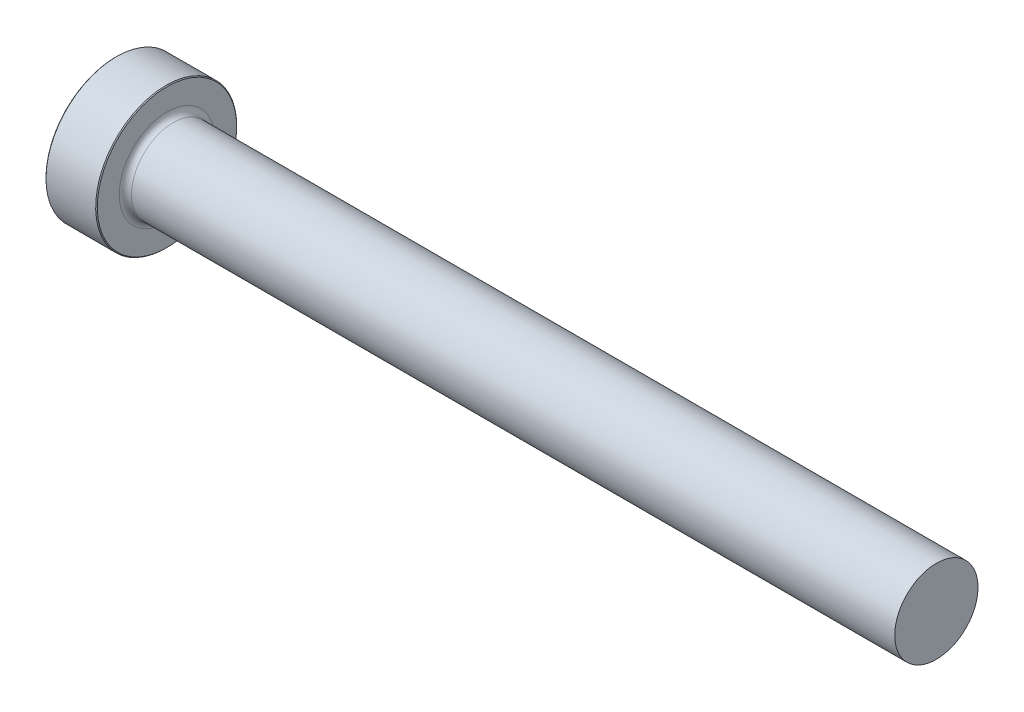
ISO-10303-21;
HEADER;
FILE_DESCRIPTION(('STEP AP214'),'2;1');
FILE_NAME('part.step','',(''),(''),'','','');
FILE_SCHEMA(('AUTOMOTIVE_DESIGN { 1 0 10303 214 1 1 1 1 }'));
ENDSEC;
DATA;
#1=APPLICATION_CONTEXT('core data for automotive mechanical design processes');
#2=APPLICATION_PROTOCOL_DEFINITION('international standard','automotive_design',2000,#1);
#3=PRODUCT_CONTEXT('',#1,'mechanical');
#4=PRODUCT('Part','Part','',(#3));
#5=PRODUCT_RELATED_PRODUCT_CATEGORY('part','',(#4));
#6=PRODUCT_DEFINITION_FORMATION('','',#4);
#7=PRODUCT_DEFINITION_CONTEXT('part definition',#1,'design');
#8=PRODUCT_DEFINITION('design','',#6,#7);
#9=PRODUCT_DEFINITION_SHAPE('','',#8);
#10=(LENGTH_UNIT() NAMED_UNIT(*) SI_UNIT(.MILLI.,.METRE.));
#11=(NAMED_UNIT(*) PLANE_ANGLE_UNIT() SI_UNIT($,.RADIAN.));
#12=(NAMED_UNIT(*) SI_UNIT($,.STERADIAN.) SOLID_ANGLE_UNIT());
#13=UNCERTAINTY_MEASURE_WITH_UNIT(LENGTH_MEASURE(1.E-05),#10,'distance_accuracy_value','');
#14=(GEOMETRIC_REPRESENTATION_CONTEXT(3) GLOBAL_UNCERTAINTY_ASSIGNED_CONTEXT((#13)) GLOBAL_UNIT_ASSIGNED_CONTEXT((#10,
#11,#12)) REPRESENTATION_CONTEXT('',''));
#15=CARTESIAN_POINT('',(0.,0.,0.));
#16=DIRECTION('',(0.,0.,1.));
#17=DIRECTION('',(1.,0.,0.));
#18=AXIS2_PLACEMENT_3D('',#15,#16,#17);
#19=CARTESIAN_POINT('',(101.6,5.15556499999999,0.));
#20=DIRECTION('',(1.,0.,0.));
#21=DIRECTION('',(0.,1.,0.));
#22=AXIS2_PLACEMENT_3D('',#19,#20,#21);
#23=PLANE('',#22);
#24=CARTESIAN_POINT('',(101.6,0.,0.));
#25=DIRECTION('',(1.,0.,0.));
#26=DIRECTION('',(0.,1.,0.));
#27=AXIS2_PLACEMENT_3D('',#24,#25,#26);
#28=CIRCLE('',#27,5.155565);
#29=CARTESIAN_POINT('',(101.6,5.15556499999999,0.));
#30=VERTEX_POINT('',#29);
#31=EDGE_CURVE('E50',#30,#30,#28,.T.);
#32=ORIENTED_EDGE('',*,*,#31,.T.);
#33=EDGE_LOOP('',(#32));
#34=FACE_BOUND('',#33,.T.);
#35=ADVANCED_FACE('F30',(#34),#23,.T.);
#36=CARTESIAN_POINT('',(101.6,0.,0.));
#37=DIRECTION('',(1.,0.,0.));
#38=DIRECTION('',(0.,1.,0.));
#39=AXIS2_PLACEMENT_3D('',#36,#37,#38);
#40=CYLINDRICAL_SURFACE('',#39,5.155565);
#41=CARTESIAN_POINT('',(7.11199999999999,0.,0.));
#42=DIRECTION('',(1.,0.,0.));
#43=DIRECTION('',(0.,1.,0.));
#44=AXIS2_PLACEMENT_3D('',#41,#42,#43);
#45=CIRCLE('',#44,5.15556499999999);
#46=CARTESIAN_POINT('',(7.11199999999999,5.15556499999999,0.));
#47=VERTEX_POINT('',#46);
#48=EDGE_CURVE('E53',#47,#47,#45,.T.);
#49=ORIENTED_EDGE('',*,*,#48,.T.);
#50=EDGE_LOOP('',(#49));
#51=FACE_BOUND('',#50,.T.);
#52=ORIENTED_EDGE('',*,*,#31,.F.);
#53=EDGE_LOOP('',(#52));
#54=FACE_BOUND('',#53,.T.);
#55=ADVANCED_FACE('F74',(#51,#54),#40,.T.);
#56=CARTESIAN_POINT('',(7.112,0.,0.));
#57=DIRECTION('',(1.,0.,0.));
#58=DIRECTION('',(0.,1.,0.));
#59=AXIS2_PLACEMENT_3D('',#56,#57,#58);
#60=TOROIDAL_SURFACE('',#59,5.91756499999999,0.761999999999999);
#61=CARTESIAN_POINT('',(6.34999999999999,0.,0.));
#62=DIRECTION('',(1.,0.,0.));
#63=DIRECTION('',(0.,1.,0.));
#64=AXIS2_PLACEMENT_3D('',#61,#62,#63);
#65=CIRCLE('',#64,5.91756499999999);
#66=CARTESIAN_POINT('',(6.34999999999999,5.91756499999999,0.));
#67=VERTEX_POINT('',#66);
#68=EDGE_CURVE('E56',#67,#67,#65,.T.);
#69=ORIENTED_EDGE('',*,*,#68,.T.);
#70=EDGE_LOOP('',(#69));
#71=FACE_BOUND('',#70,.T.);
#72=ORIENTED_EDGE('',*,*,#48,.F.);
#73=EDGE_LOOP('',(#72));
#74=FACE_BOUND('',#73,.T.);
#75=ADVANCED_FACE('F60',(#71,#74),#60,.F.);
#76=CARTESIAN_POINT('',(6.35,8.73125,0.));
#77=DIRECTION('',(1.,0.,0.));
#78=DIRECTION('',(0.,1.,0.));
#79=AXIS2_PLACEMENT_3D('',#76,#77,#78);
#80=PLANE('',#79);
#81=CARTESIAN_POINT('',(6.35,0.,0.));
#82=DIRECTION('',(1.,0.,0.));
#83=DIRECTION('',(0.,1.,0.));
#84=AXIS2_PLACEMENT_3D('',#81,#82,#83);
#85=CIRCLE('',#84,8.62964999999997);
#86=CARTESIAN_POINT('',(6.35,8.62964999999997,0.));
#87=VERTEX_POINT('',#86);
#88=EDGE_CURVE('E10',#87,#87,#85,.T.);
#89=ORIENTED_EDGE('',*,*,#88,.T.);
#90=EDGE_LOOP('',(#89));
#91=FACE_BOUND('',#90,.T.);
#92=ORIENTED_EDGE('',*,*,#68,.F.);
#93=EDGE_LOOP('',(#92));
#94=FACE_BOUND('',#93,.T.);
#95=ADVANCED_FACE('F63',(#91,#94),#80,.T.);
#96=CARTESIAN_POINT('',(101.6,0.,0.));
#97=DIRECTION('',(1.,0.,0.));
#98=DIRECTION('',(0.,1.,0.));
#99=AXIS2_PLACEMENT_3D('',#96,#97,#98);
#100=CYLINDRICAL_SURFACE('',#99,8.73125);
#101=CARTESIAN_POINT('',(0.101600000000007,0.,0.));
#102=DIRECTION('',(-1.,0.,0.));
#103=DIRECTION('',(0.,-1.,0.));
#104=AXIS2_PLACEMENT_3D('',#101,#102,#103);
#105=CIRCLE('',#104,8.73125);
#106=CARTESIAN_POINT('',(0.101600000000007,-8.73125,0.));
#107=VERTEX_POINT('',#106);
#108=EDGE_CURVE('E41',#107,#107,#105,.F.);
#109=ORIENTED_EDGE('',*,*,#108,.T.);
#110=EDGE_LOOP('',(#109));
#111=FACE_BOUND('',#110,.T.);
#112=CARTESIAN_POINT('',(6.24839999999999,0.,0.));
#113=DIRECTION('',(1.,0.,0.));
#114=DIRECTION('',(0.,1.,0.));
#115=AXIS2_PLACEMENT_3D('',#112,#113,#114);
#116=CIRCLE('',#115,8.73125);
#117=CARTESIAN_POINT('',(6.24839999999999,8.73125,0.));
#118=VERTEX_POINT('',#117);
#119=EDGE_CURVE('E45',#118,#118,#116,.F.);
#120=ORIENTED_EDGE('',*,*,#119,.T.);
#121=EDGE_LOOP('',(#120));
#122=FACE_BOUND('',#121,.T.);
#123=ADVANCED_FACE('F65',(#111,#122),#100,.T.);
#124=CARTESIAN_POINT('',(0.,0.,0.));
#125=DIRECTION('',(-1.,0.,0.));
#126=DIRECTION('',(0.,-1.,0.));
#127=AXIS2_PLACEMENT_3D('',#124,#125,#126);
#128=PLANE('',#127);
#129=CARTESIAN_POINT('',(0.,0.,0.));
#130=DIRECTION('',(-1.,0.,0.));
#131=DIRECTION('',(0.,-1.,0.));
#132=AXIS2_PLACEMENT_3D('',#129,#130,#131);
#133=CIRCLE('',#132,8.62964999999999);
#134=CARTESIAN_POINT('',(0.,-8.62964999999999,0.));
#135=VERTEX_POINT('',#134);
#136=EDGE_CURVE('E37',#135,#135,#133,.T.);
#137=ORIENTED_EDGE('',*,*,#136,.T.);
#138=EDGE_LOOP('',(#137));
#139=FACE_BOUND('',#138,.T.);
#140=ADVANCED_FACE('F71',(#139),#128,.T.);
#141=CARTESIAN_POINT('',(0.101600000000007,0.,0.));
#142=DIRECTION('',(1.,0.,0.));
#143=DIRECTION('',(0.,1.,0.));
#144=AXIS2_PLACEMENT_3D('',#141,#142,#143);
#145=CONICAL_SURFACE('',#144,8.73125,0.785398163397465);
#146=ORIENTED_EDGE('',*,*,#136,.F.);
#147=EDGE_LOOP('',(#146));
#148=FACE_BOUND('',#147,.T.);
#149=ORIENTED_EDGE('',*,*,#108,.F.);
#150=EDGE_LOOP('',(#149));
#151=FACE_BOUND('',#150,.T.);
#152=ADVANCED_FACE('F84',(#148,#151),#145,.T.);
#153=CARTESIAN_POINT('',(6.34999999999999,0.,0.));
#154=DIRECTION('',(-1.,0.,0.));
#155=DIRECTION('',(0.,-1.,0.));
#156=AXIS2_PLACEMENT_3D('',#153,#154,#155);
#157=CONICAL_SURFACE('',#156,8.62964999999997,0.785398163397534);
#158=ORIENTED_EDGE('',*,*,#119,.F.);
#159=EDGE_LOOP('',(#158));
#160=FACE_BOUND('',#159,.T.);
#161=ORIENTED_EDGE('',*,*,#88,.F.);
#162=EDGE_LOOP('',(#161));
#163=FACE_BOUND('',#162,.T.);
#164=ADVANCED_FACE('F32',(#160,#163),#157,.T.);
#165=CLOSED_SHELL('',(#35,#55,#75,#95,#123,#140,#152,#164));
#166=MANIFOLD_SOLID_BREP('B2',#165);
#167=ADVANCED_BREP_SHAPE_REPRESENTATION('',(#18,#166),#14);
#168=SHAPE_DEFINITION_REPRESENTATION(#9,#167);
ENDSEC;
END-ISO-10303-21;
